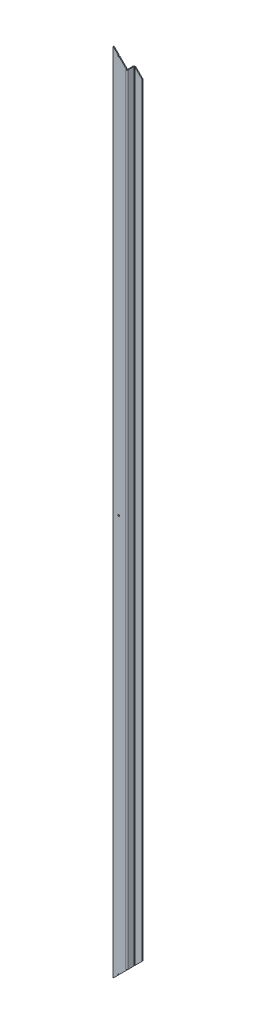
ISO-10303-21;
HEADER;
FILE_DESCRIPTION(('STEP AP214'),'2;1');
FILE_NAME('part.step','',(''),(''),'','','');
FILE_SCHEMA(('AUTOMOTIVE_DESIGN { 1 0 10303 214 1 1 1 1 }'));
ENDSEC;
DATA;
#1=APPLICATION_CONTEXT('core data for automotive mechanical design processes');
#2=APPLICATION_PROTOCOL_DEFINITION('international standard','automotive_design',2000,#1);
#3=PRODUCT_CONTEXT('',#1,'mechanical');
#4=PRODUCT('Part','Part','',(#3));
#5=PRODUCT_RELATED_PRODUCT_CATEGORY('part','',(#4));
#6=PRODUCT_DEFINITION_FORMATION('','',#4);
#7=PRODUCT_DEFINITION_CONTEXT('part definition',#1,'design');
#8=PRODUCT_DEFINITION('design','',#6,#7);
#9=PRODUCT_DEFINITION_SHAPE('','',#8);
#10=(LENGTH_UNIT() NAMED_UNIT(*) SI_UNIT(.MILLI.,.METRE.));
#11=(NAMED_UNIT(*) PLANE_ANGLE_UNIT() SI_UNIT($,.RADIAN.));
#12=(NAMED_UNIT(*) SI_UNIT($,.STERADIAN.) SOLID_ANGLE_UNIT());
#13=UNCERTAINTY_MEASURE_WITH_UNIT(LENGTH_MEASURE(1.E-05),#10,'distance_accuracy_value','');
#14=(GEOMETRIC_REPRESENTATION_CONTEXT(3) GLOBAL_UNCERTAINTY_ASSIGNED_CONTEXT((#13)) GLOBAL_UNIT_ASSIGNED_CONTEXT((#10,
#11,#12)) REPRESENTATION_CONTEXT('',''));
#15=CARTESIAN_POINT('',(0.,0.,0.));
#16=DIRECTION('',(0.,0.,1.));
#17=DIRECTION('',(1.,0.,0.));
#18=AXIS2_PLACEMENT_3D('',#15,#16,#17);
#19=CARTESIAN_POINT('',(-159.,703.,1.5));
#20=DIRECTION('',(-0.707106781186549,-0.707106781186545,0.));
#21=DIRECTION('',(0.707106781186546,-0.707106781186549,0.));
#22=AXIS2_PLACEMENT_3D('',#19,#20,#21);
#23=PLANE('',#22);
#24=DIRECTION('',(-0.707106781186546,0.707106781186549,0.));
#25=VECTOR('',#24,1.);
#26=CARTESIAN_POINT('',(-159.,703.,0.));
#27=LINE('',#26,#25);
#28=CARTESIAN_POINT('',(-159.,703.,0.));
#29=VERTEX_POINT('',#28);
#30=CARTESIAN_POINT('',(-172.93933982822,716.93933982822,0.));
#31=VERTEX_POINT('',#30);
#32=EDGE_CURVE('E238',#29,#31,#27,.T.);
#33=ORIENTED_EDGE('',*,*,#32,.T.);
#34=DIRECTION('',(0.,0.,1.));
#35=VECTOR('',#34,1.);
#36=CARTESIAN_POINT('',(-172.93933982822,716.93933982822,0.));
#37=LINE('',#36,#35);
#38=CARTESIAN_POINT('',(-172.93933982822,716.93933982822,1.5));
#39=VERTEX_POINT('',#38);
#40=EDGE_CURVE('E13',#31,#39,#37,.T.);
#41=ORIENTED_EDGE('',*,*,#40,.T.);
#42=DIRECTION('',(-0.707106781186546,0.707106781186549,0.));
#43=VECTOR('',#42,1.);
#44=CARTESIAN_POINT('',(-159.,703.,1.5));
#45=LINE('',#44,#43);
#46=CARTESIAN_POINT('',(-159.,703.,1.5));
#47=VERTEX_POINT('',#46);
#48=EDGE_CURVE('E234',#47,#39,#45,.T.);
#49=ORIENTED_EDGE('',*,*,#48,.F.);
#50=DIRECTION('',(0.,0.,-1.));
#51=VECTOR('',#50,1.);
#52=CARTESIAN_POINT('',(-159.,703.,1.5));
#53=LINE('',#52,#51);
#54=EDGE_CURVE('E256',#47,#29,#53,.T.);
#55=ORIENTED_EDGE('',*,*,#54,.T.);
#56=EDGE_LOOP('',(#33,#41,#49,#55));
#57=FACE_BOUND('',#56,.T.);
#58=ADVANCED_FACE('F78',(#57),#23,.F.);
#59=CARTESIAN_POINT('',(-159.,-703.,1.5));
#60=DIRECTION('',(-0.707106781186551,0.707106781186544,0.));
#61=DIRECTION('',(-0.707106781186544,-0.707106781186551,0.));
#62=AXIS2_PLACEMENT_3D('',#59,#60,#61);
#63=PLANE('',#62);
#64=DIRECTION('',(0.707106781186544,0.707106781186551,0.));
#65=VECTOR('',#64,1.);
#66=CARTESIAN_POINT('',(-159.,-703.,0.));
#67=LINE('',#66,#65);
#68=CARTESIAN_POINT('',(-184.,-728.,0.));
#69=VERTEX_POINT('',#68);
#70=CARTESIAN_POINT('',(-175.060660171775,-719.060660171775,0.));
#71=VERTEX_POINT('',#70);
#72=EDGE_CURVE('E245',#69,#71,#67,.T.);
#73=ORIENTED_EDGE('',*,*,#72,.T.);
#74=DIRECTION('',(0.,0.,1.));
#75=VECTOR('',#74,1.);
#76=CARTESIAN_POINT('',(-175.060660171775,-719.060660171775,0.));
#77=LINE('',#76,#75);
#78=CARTESIAN_POINT('',(-175.060660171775,-719.060660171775,1.5));
#79=VERTEX_POINT('',#78);
#80=EDGE_CURVE('E214',#71,#79,#77,.T.);
#81=ORIENTED_EDGE('',*,*,#80,.T.);
#82=DIRECTION('',(0.707106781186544,0.707106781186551,0.));
#83=VECTOR('',#82,1.);
#84=CARTESIAN_POINT('',(-159.,-703.,1.5));
#85=LINE('',#84,#83);
#86=CARTESIAN_POINT('',(-184.,-728.,1.5));
#87=VERTEX_POINT('',#86);
#88=EDGE_CURVE('E226',#87,#79,#85,.T.);
#89=ORIENTED_EDGE('',*,*,#88,.F.);
#90=DIRECTION('',(0.,0.,-1.));
#91=VECTOR('',#90,1.);
#92=CARTESIAN_POINT('',(-184.,-728.,1.5));
#93=LINE('',#92,#91);
#94=EDGE_CURVE('E250',#87,#69,#93,.T.);
#95=ORIENTED_EDGE('',*,*,#94,.T.);
#96=EDGE_LOOP('',(#73,#81,#89,#95));
#97=FACE_BOUND('',#96,.T.);
#98=ADVANCED_FACE('F283',(#97),#63,.F.);
#99=CARTESIAN_POINT('',(-159.,703.,-13.3));
#100=DIRECTION('',(0.,1.,0.));
#101=DIRECTION('',(0.,0.,1.));
#102=AXIS2_PLACEMENT_3D('',#99,#100,#101);
#103=PLANE('',#102);
#104=DIRECTION('',(0.,0.,-1.));
#105=VECTOR('',#104,1.);
#106=CARTESIAN_POINT('',(-159.,703.,-13.3));
#107=LINE('',#106,#105);
#108=CARTESIAN_POINT('',(-159.,703.,-0.999999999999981));
#109=VERTEX_POINT('',#108);
#110=CARTESIAN_POINT('',(-159.,703.,-10.8));
#111=VERTEX_POINT('',#110);
#112=EDGE_CURVE('E503',#109,#111,#107,.T.);
#113=ORIENTED_EDGE('',*,*,#112,.T.);
#114=DIRECTION('',(-1.,0.,0.));
#115=VECTOR('',#114,1.);
#116=CARTESIAN_POINT('',(-159.,703.,-10.8));
#117=LINE('',#116,#115);
#118=CARTESIAN_POINT('',(-160.5,703.,-10.8));
#119=VERTEX_POINT('',#118);
#120=EDGE_CURVE('E335',#111,#119,#117,.T.);
#121=ORIENTED_EDGE('',*,*,#120,.T.);
#122=DIRECTION('',(0.,0.,1.));
#123=VECTOR('',#122,1.);
#124=CARTESIAN_POINT('',(-160.5,703.,-6.63629552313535E-13));
#125=LINE('',#124,#123);
#126=CARTESIAN_POINT('',(-160.5,703.,-0.999999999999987));
#127=VERTEX_POINT('',#126);
#128=EDGE_CURVE('E500',#127,#119,#125,.F.);
#129=ORIENTED_EDGE('',*,*,#128,.F.);
#130=DIRECTION('',(1.,0.,0.));
#131=VECTOR('',#130,1.);
#132=CARTESIAN_POINT('',(-159.,703.,-0.999999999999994));
#133=LINE('',#132,#131);
#134=EDGE_CURVE('E334',#127,#109,#133,.T.);
#135=ORIENTED_EDGE('',*,*,#134,.T.);
#136=EDGE_LOOP('',(#113,#121,#129,#135));
#137=FACE_BOUND('',#136,.T.);
#138=ADVANCED_FACE('F399',(#137),#103,.T.);
#139=CARTESIAN_POINT('',(-159.,0.,-6.5839233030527E-13));
#140=DIRECTION('',(1.,0.,0.));
#141=DIRECTION('',(0.,0.,-1.));
#142=AXIS2_PLACEMENT_3D('',#139,#140,#141);
#143=PLANE('',#142);
#144=DIRECTION('',(0.,0.,1.));
#145=VECTOR('',#144,1.);
#146=CARTESIAN_POINT('',(-159.,-703.,0.));
#147=LINE('',#146,#145);
#148=CARTESIAN_POINT('',(-159.,-703.,-10.8));
#149=VERTEX_POINT('',#148);
#150=CARTESIAN_POINT('',(-159.,-703.,-0.999999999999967));
#151=VERTEX_POINT('',#150);
#152=EDGE_CURVE('E381',#149,#151,#147,.T.);
#153=ORIENTED_EDGE('',*,*,#152,.F.);
#154=DIRECTION('',(0.,1.,0.));
#155=VECTOR('',#154,1.);
#156=CARTESIAN_POINT('',(-159.,703.,-10.8));
#157=LINE('',#156,#155);
#158=EDGE_CURVE('E323',#111,#149,#157,.F.);
#159=ORIENTED_EDGE('',*,*,#158,.F.);
#160=ORIENTED_EDGE('',*,*,#112,.F.);
#161=DIRECTION('',(0.,-1.,0.));
#162=VECTOR('',#161,1.);
#163=CARTESIAN_POINT('',(-159.,0.,-0.99999999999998));
#164=LINE('',#163,#162);
#165=EDGE_CURVE('E469',#109,#151,#164,.T.);
#166=ORIENTED_EDGE('',*,*,#165,.T.);
#167=EDGE_LOOP('',(#153,#159,#160,#166));
#168=FACE_BOUND('',#167,.T.);
#169=ADVANCED_FACE('F389',(#168),#143,.T.);
#170=CARTESIAN_POINT('',(-160.5,0.,-6.63629552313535E-13));
#171=DIRECTION('',(1.,0.,0.));
#172=DIRECTION('',(0.,0.,-1.));
#173=AXIS2_PLACEMENT_3D('',#170,#171,#172);
#174=PLANE('',#173);
#175=DIRECTION('',(0.,1.,0.));
#176=VECTOR('',#175,1.);
#177=CARTESIAN_POINT('',(-160.5,703.,-10.8));
#178=LINE('',#177,#176);
#179=CARTESIAN_POINT('',(-160.5,-703.,-10.8));
#180=VERTEX_POINT('',#179);
#181=EDGE_CURVE('E327',#119,#180,#178,.F.);
#182=ORIENTED_EDGE('',*,*,#181,.T.);
#183=DIRECTION('',(0.,0.,-1.));
#184=VECTOR('',#183,1.);
#185=CARTESIAN_POINT('',(-160.5,-703.,-6.63629552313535E-13));
#186=LINE('',#185,#184);
#187=CARTESIAN_POINT('',(-160.5,-703.,-0.999999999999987));
#188=VERTEX_POINT('',#187);
#189=EDGE_CURVE('E502',#180,#188,#186,.F.);
#190=ORIENTED_EDGE('',*,*,#189,.T.);
#191=DIRECTION('',(0.,1.,0.));
#192=VECTOR('',#191,1.);
#193=CARTESIAN_POINT('',(-160.5,703.,-1.));
#194=LINE('',#193,#192);
#195=EDGE_CURVE('E492',#127,#188,#194,.F.);
#196=ORIENTED_EDGE('',*,*,#195,.F.);
#197=ORIENTED_EDGE('',*,*,#128,.T.);
#198=EDGE_LOOP('',(#182,#190,#196,#197));
#199=FACE_BOUND('',#198,.T.);
#200=ADVANCED_FACE('F398',(#199),#174,.F.);
#201=CARTESIAN_POINT('',(-159.,-703.,0.));
#202=DIRECTION('',(0.,1.,0.));
#203=DIRECTION('',(0.,0.,1.));
#204=AXIS2_PLACEMENT_3D('',#201,#202,#203);
#205=PLANE('',#204);
#206=DIRECTION('',(-1.,0.,0.));
#207=VECTOR('',#206,1.);
#208=CARTESIAN_POINT('',(-159.,-703.,0.));
#209=LINE('',#208,#207);
#210=CARTESIAN_POINT('',(-159.,-703.,0.));
#211=VERTEX_POINT('',#210);
#212=CARTESIAN_POINT('',(-159.208712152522,-703.,0.));
#213=VERTEX_POINT('',#212);
#214=EDGE_CURVE('E272',#211,#213,#209,.T.);
#215=ORIENTED_EDGE('',*,*,#214,.T.);
#216=CARTESIAN_POINT('',(-161.5,-703.,-0.999999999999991));
#217=DIRECTION('',(0.,-1.,0.));
#218=DIRECTION('',(0.,0.,-1.));
#219=AXIS2_PLACEMENT_3D('',#216,#217,#218);
#220=CIRCLE('',#219,2.5);
#221=CARTESIAN_POINT('',(-161.5,-703.,1.5));
#222=VERTEX_POINT('',#221);
#223=EDGE_CURVE('E215',#213,#222,#220,.T.);
#224=ORIENTED_EDGE('',*,*,#223,.T.);
#225=DIRECTION('',(-1.,0.,0.));
#226=VECTOR('',#225,1.);
#227=CARTESIAN_POINT('',(0.,-703.,1.5));
#228=LINE('',#227,#226);
#229=CARTESIAN_POINT('',(-159.,-703.,1.5));
#230=VERTEX_POINT('',#229);
#231=EDGE_CURVE('E268',#230,#222,#228,.T.);
#232=ORIENTED_EDGE('',*,*,#231,.F.);
#233=DIRECTION('',(0.,0.,-1.));
#234=VECTOR('',#233,1.);
#235=CARTESIAN_POINT('',(-159.,-703.,1.5));
#236=LINE('',#235,#234);
#237=EDGE_CURVE('E230',#230,#211,#236,.T.);
#238=ORIENTED_EDGE('',*,*,#237,.T.);
#239=EDGE_LOOP('',(#215,#224,#232,#238));
#240=FACE_BOUND('',#239,.T.);
#241=ADVANCED_FACE('F403',(#240),#205,.T.);
#242=CARTESIAN_POINT('',(-161.5,703.,0.));
#243=DIRECTION('',(0.,-1.,0.));
#244=DIRECTION('',(0.,0.,-1.));
#245=AXIS2_PLACEMENT_3D('',#242,#243,#244);
#246=PLANE('',#245);
#247=DIRECTION('',(1.,0.,0.));
#248=VECTOR('',#247,1.);
#249=CARTESIAN_POINT('',(0.,703.,1.5));
#250=LINE('',#249,#248);
#251=CARTESIAN_POINT('',(-161.5,703.,1.5));
#252=VERTEX_POINT('',#251);
#253=EDGE_CURVE('E269',#252,#47,#250,.T.);
#254=ORIENTED_EDGE('',*,*,#253,.F.);
#255=CARTESIAN_POINT('',(-161.5,703.,-0.999999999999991));
#256=DIRECTION('',(0.,-1.,0.));
#257=DIRECTION('',(0.,0.,-1.));
#258=AXIS2_PLACEMENT_3D('',#255,#256,#257);
#259=CIRCLE('',#258,2.5);
#260=CARTESIAN_POINT('',(-159.208712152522,703.,0.));
#261=VERTEX_POINT('',#260);
#262=EDGE_CURVE('E456',#252,#261,#259,.F.);
#263=ORIENTED_EDGE('',*,*,#262,.T.);
#264=DIRECTION('',(1.,0.,0.));
#265=VECTOR('',#264,1.);
#266=CARTESIAN_POINT('',(-161.5,703.,0.));
#267=LINE('',#266,#265);
#268=EDGE_CURVE('E451',#261,#29,#267,.T.);
#269=ORIENTED_EDGE('',*,*,#268,.T.);
#270=ORIENTED_EDGE('',*,*,#54,.F.);
#271=EDGE_LOOP('',(#254,#263,#269,#270));
#272=FACE_BOUND('',#271,.T.);
#273=ADVANCED_FACE('F428',(#272),#246,.T.);
#274=CARTESIAN_POINT('',(0.,0.,1.5));
#275=DIRECTION('',(0.,0.,1.));
#276=DIRECTION('',(1.,0.,0.));
#277=AXIS2_PLACEMENT_3D('',#274,#275,#276);
#278=PLANE('',#277);
#279=CARTESIAN_POINT('',(-174.,718.,1.5));
#280=DIRECTION('',(0.,0.,1.));
#281=DIRECTION('',(1.,0.,0.));
#282=AXIS2_PLACEMENT_3D('',#279,#280,#281);
#283=CIRCLE('',#282,1.5);
#284=CARTESIAN_POINT('',(-175.06066017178,719.06066017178,1.5));
#285=VERTEX_POINT('',#284);
#286=EDGE_CURVE('E279',#285,#39,#283,.T.);
#287=ORIENTED_EDGE('',*,*,#286,.F.);
#288=CARTESIAN_POINT('',(-184.,728.,1.5));
#289=VERTEX_POINT('',#288);
#290=EDGE_CURVE('E248',#285,#289,#45,.T.);
#291=ORIENTED_EDGE('',*,*,#290,.T.);
#292=DIRECTION('',(0.,-1.,0.));
#293=VECTOR('',#292,1.);
#294=CARTESIAN_POINT('',(-184.,-728.,1.5));
#295=LINE('',#294,#293);
#296=EDGE_CURVE('E232',#289,#87,#295,.T.);
#297=ORIENTED_EDGE('',*,*,#296,.T.);
#298=ORIENTED_EDGE('',*,*,#88,.T.);
#299=CARTESIAN_POINT('',(-173.999999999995,-717.999999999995,1.5));
#300=DIRECTION('',(0.,0.,1.));
#301=DIRECTION('',(1.,0.,0.));
#302=AXIS2_PLACEMENT_3D('',#299,#300,#301);
#303=CIRCLE('',#302,1.5);
#304=CARTESIAN_POINT('',(-172.939339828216,-716.939339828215,1.5));
#305=VERTEX_POINT('',#304);
#306=EDGE_CURVE('E209',#305,#79,#303,.T.);
#307=ORIENTED_EDGE('',*,*,#306,.F.);
#308=EDGE_CURVE('E223',#305,#230,#85,.T.);
#309=ORIENTED_EDGE('',*,*,#308,.T.);
#310=ORIENTED_EDGE('',*,*,#231,.T.);
#311=DIRECTION('',(0.,-1.,0.));
#312=VECTOR('',#311,1.);
#313=CARTESIAN_POINT('',(-161.5,-703.,1.50000000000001));
#314=LINE('',#313,#312);
#315=EDGE_CURVE('E471',#222,#252,#314,.F.);
#316=ORIENTED_EDGE('',*,*,#315,.T.);
#317=ORIENTED_EDGE('',*,*,#253,.T.);
#318=ORIENTED_EDGE('',*,*,#48,.T.);
#319=EDGE_LOOP('',(#287,#291,#297,#298,#307,#309,#310,#316,#317,#318));
#320=FACE_BOUND('',#319,.T.);
#321=CARTESIAN_POINT('',(-173.999999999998,2.44249065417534E-12,1.5));
#322=DIRECTION('',(0.,0.,1.));
#323=DIRECTION('',(1.,0.,0.));
#324=AXIS2_PLACEMENT_3D('',#321,#322,#323);
#325=CIRCLE('',#324,1.5);
#326=CARTESIAN_POINT('',(-172.499999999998,2.44249065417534E-12,1.5));
#327=VERTEX_POINT('',#326);
#328=EDGE_CURVE('E285',#327,#327,#325,.T.);
#329=ORIENTED_EDGE('',*,*,#328,.F.);
#330=EDGE_LOOP('',(#329));
#331=FACE_BOUND('',#330,.T.);
#332=ADVANCED_FACE('F220',(#320,#331),#278,.T.);
#333=CARTESIAN_POINT('',(0.,0.,0.));
#334=DIRECTION('',(0.,0.,1.));
#335=DIRECTION('',(1.,0.,0.));
#336=AXIS2_PLACEMENT_3D('',#333,#334,#335);
#337=PLANE('',#336);
#338=CARTESIAN_POINT('',(-173.999999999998,2.44249065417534E-12,0.));
#339=DIRECTION('',(0.,0.,1.));
#340=DIRECTION('',(1.,0.,0.));
#341=AXIS2_PLACEMENT_3D('',#338,#339,#340);
#342=CIRCLE('',#341,1.5);
#343=CARTESIAN_POINT('',(-172.499999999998,2.44249065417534E-12,0.));
#344=VERTEX_POINT('',#343);
#345=EDGE_CURVE('E288',#344,#344,#342,.T.);
#346=ORIENTED_EDGE('',*,*,#345,.T.);
#347=EDGE_LOOP('',(#346));
#348=FACE_BOUND('',#347,.T.);
#349=CARTESIAN_POINT('',(-175.06066017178,719.06066017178,0.));
#350=VERTEX_POINT('',#349);
#351=CARTESIAN_POINT('',(-184.,728.,0.));
#352=VERTEX_POINT('',#351);
#353=EDGE_CURVE('E242',#350,#352,#27,.T.);
#354=ORIENTED_EDGE('',*,*,#353,.F.);
#355=CARTESIAN_POINT('',(-174.,718.,0.));
#356=DIRECTION('',(0.,0.,1.));
#357=DIRECTION('',(1.,0.,0.));
#358=AXIS2_PLACEMENT_3D('',#355,#356,#357);
#359=CIRCLE('',#358,1.5);
#360=EDGE_CURVE('E93',#350,#31,#359,.T.);
#361=ORIENTED_EDGE('',*,*,#360,.T.);
#362=ORIENTED_EDGE('',*,*,#32,.F.);
#363=ORIENTED_EDGE('',*,*,#268,.F.);
#364=CARTESIAN_POINT('',(-161.5,703.,0.));
#365=VERTEX_POINT('',#364);
#366=EDGE_CURVE('E454',#365,#261,#267,.T.);
#367=ORIENTED_EDGE('',*,*,#366,.F.);
#368=DIRECTION('',(0.,-1.,0.));
#369=VECTOR('',#368,1.);
#370=CARTESIAN_POINT('',(-161.5,-703.,0.));
#371=LINE('',#370,#369);
#372=CARTESIAN_POINT('',(-161.5,-703.,0.));
#373=VERTEX_POINT('',#372);
#374=EDGE_CURVE('E479',#373,#365,#371,.F.);
#375=ORIENTED_EDGE('',*,*,#374,.F.);
#376=EDGE_CURVE('E466',#213,#373,#209,.T.);
#377=ORIENTED_EDGE('',*,*,#376,.F.);
#378=ORIENTED_EDGE('',*,*,#214,.F.);
#379=CARTESIAN_POINT('',(-172.939339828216,-716.939339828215,0.));
#380=VERTEX_POINT('',#379);
#381=EDGE_CURVE('E244',#380,#211,#67,.T.);
#382=ORIENTED_EDGE('',*,*,#381,.F.);
#383=CARTESIAN_POINT('',(-173.999999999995,-717.999999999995,0.));
#384=DIRECTION('',(0.,0.,1.));
#385=DIRECTION('',(1.,0.,0.));
#386=AXIS2_PLACEMENT_3D('',#383,#384,#385);
#387=CIRCLE('',#386,1.5);
#388=EDGE_CURVE('E101',#380,#71,#387,.T.);
#389=ORIENTED_EDGE('',*,*,#388,.T.);
#390=ORIENTED_EDGE('',*,*,#72,.F.);
#391=DIRECTION('',(0.,-1.,0.));
#392=VECTOR('',#391,1.);
#393=CARTESIAN_POINT('',(-184.,-728.,0.));
#394=LINE('',#393,#392);
#395=EDGE_CURVE('E241',#352,#69,#394,.T.);
#396=ORIENTED_EDGE('',*,*,#395,.F.);
#397=EDGE_LOOP('',(#354,#361,#362,#363,#367,#375,#377,#378,#382,#389,#390,#396));
#398=FACE_BOUND('',#397,.T.);
#399=ADVANCED_FACE('F265',(#348,#398),#337,.F.);
#400=ORIENTED_EDGE('',*,*,#290,.F.);
#401=DIRECTION('',(0.,0.,1.));
#402=VECTOR('',#401,1.);
#403=CARTESIAN_POINT('',(-175.06066017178,719.06066017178,0.));
#404=LINE('',#403,#402);
#405=EDGE_CURVE('E86',#285,#350,#404,.F.);
#406=ORIENTED_EDGE('',*,*,#405,.T.);
#407=ORIENTED_EDGE('',*,*,#353,.T.);
#408=DIRECTION('',(0.,0.,-1.));
#409=VECTOR('',#408,1.);
#410=CARTESIAN_POINT('',(-184.,728.,1.5));
#411=LINE('',#410,#409);
#412=EDGE_CURVE('E253',#289,#352,#411,.T.);
#413=ORIENTED_EDGE('',*,*,#412,.F.);
#414=EDGE_LOOP('',(#400,#406,#407,#413));
#415=FACE_BOUND('',#414,.T.);
#416=ADVANCED_FACE('F80',(#415),#23,.F.);
#417=CARTESIAN_POINT('',(-184.,-728.,1.5));
#418=DIRECTION('',(1.,0.,0.));
#419=DIRECTION('',(0.,0.,-1.));
#420=AXIS2_PLACEMENT_3D('',#417,#418,#419);
#421=PLANE('',#420);
#422=ORIENTED_EDGE('',*,*,#395,.T.);
#423=ORIENTED_EDGE('',*,*,#94,.F.);
#424=ORIENTED_EDGE('',*,*,#296,.F.);
#425=ORIENTED_EDGE('',*,*,#412,.T.);
#426=EDGE_LOOP('',(#422,#423,#424,#425));
#427=FACE_BOUND('',#426,.T.);
#428=ADVANCED_FACE('F281',(#427),#421,.F.);
#429=ORIENTED_EDGE('',*,*,#308,.F.);
#430=DIRECTION('',(0.,0.,1.));
#431=VECTOR('',#430,1.);
#432=CARTESIAN_POINT('',(-172.939339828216,-716.939339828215,0.));
#433=LINE('',#432,#431);
#434=EDGE_CURVE('E206',#305,#380,#433,.F.);
#435=ORIENTED_EDGE('',*,*,#434,.T.);
#436=ORIENTED_EDGE('',*,*,#381,.T.);
#437=ORIENTED_EDGE('',*,*,#237,.F.);
#438=EDGE_LOOP('',(#429,#435,#436,#437));
#439=FACE_BOUND('',#438,.T.);
#440=ADVANCED_FACE('F228',(#439),#63,.F.);
#441=CARTESIAN_POINT('',(-161.5,703.,-0.999999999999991));
#442=DIRECTION('',(0.,1.,0.));
#443=DIRECTION('',(0.,0.,1.));
#444=AXIS2_PLACEMENT_3D('',#441,#442,#443);
#445=PLANE('',#444);
#446=CARTESIAN_POINT('',(-161.5,703.,-0.999999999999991));
#447=DIRECTION('',(0.,-1.,0.));
#448=DIRECTION('',(0.,0.,-1.));
#449=AXIS2_PLACEMENT_3D('',#446,#447,#448);
#450=CIRCLE('',#449,1.);
#451=EDGE_CURVE('E465',#365,#127,#450,.F.);
#452=ORIENTED_EDGE('',*,*,#451,.F.);
#453=ORIENTED_EDGE('',*,*,#366,.T.);
#454=EDGE_CURVE('E460',#261,#109,#259,.F.);
#455=ORIENTED_EDGE('',*,*,#454,.T.);
#456=ORIENTED_EDGE('',*,*,#134,.F.);
#457=EDGE_LOOP('',(#452,#453,#455,#456));
#458=FACE_BOUND('',#457,.T.);
#459=ADVANCED_FACE('F421',(#458),#445,.T.);
#460=CARTESIAN_POINT('',(-161.5,-703.,-0.999999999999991));
#461=DIRECTION('',(0.,1.,0.));
#462=DIRECTION('',(0.,0.,1.));
#463=AXIS2_PLACEMENT_3D('',#460,#461,#462);
#464=PLANE('',#463);
#465=EDGE_CURVE('E472',#151,#213,#220,.T.);
#466=ORIENTED_EDGE('',*,*,#465,.T.);
#467=ORIENTED_EDGE('',*,*,#376,.T.);
#468=CARTESIAN_POINT('',(-161.5,-703.,-0.999999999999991));
#469=DIRECTION('',(0.,-1.,0.));
#470=DIRECTION('',(0.,0.,-1.));
#471=AXIS2_PLACEMENT_3D('',#468,#469,#470);
#472=CIRCLE('',#471,1.);
#473=EDGE_CURVE('E481',#188,#373,#472,.T.);
#474=ORIENTED_EDGE('',*,*,#473,.F.);
#475=DIRECTION('',(1.,0.,0.));
#476=VECTOR('',#475,1.);
#477=CARTESIAN_POINT('',(-160.5,-703.,-0.999999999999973));
#478=LINE('',#477,#476);
#479=EDGE_CURVE('E495',#188,#151,#478,.T.);
#480=ORIENTED_EDGE('',*,*,#479,.T.);
#481=EDGE_LOOP('',(#466,#467,#474,#480));
#482=FACE_BOUND('',#481,.T.);
#483=ADVANCED_FACE('F416',(#482),#464,.F.);
#484=CARTESIAN_POINT('',(-161.5,-703.,-0.999999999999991));
#485=DIRECTION('',(0.,-1.,0.));
#486=DIRECTION('',(1.,0.,0.));
#487=AXIS2_PLACEMENT_3D('',#484,#485,#486);
#488=CYLINDRICAL_SURFACE('',#487,2.5);
#489=ORIENTED_EDGE('',*,*,#315,.F.);
#490=ORIENTED_EDGE('',*,*,#223,.F.);
#491=ORIENTED_EDGE('',*,*,#465,.F.);
#492=ORIENTED_EDGE('',*,*,#165,.F.);
#493=ORIENTED_EDGE('',*,*,#454,.F.);
#494=ORIENTED_EDGE('',*,*,#262,.F.);
#495=EDGE_LOOP('',(#489,#490,#491,#492,#493,#494));
#496=FACE_BOUND('',#495,.T.);
#497=ADVANCED_FACE('F413',(#496),#488,.T.);
#498=CARTESIAN_POINT('',(-161.5,-703.,-0.999999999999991));
#499=DIRECTION('',(0.,-1.,0.));
#500=DIRECTION('',(1.,0.,0.));
#501=AXIS2_PLACEMENT_3D('',#498,#499,#500);
#502=CYLINDRICAL_SURFACE('',#501,1.);
#503=ORIENTED_EDGE('',*,*,#374,.T.);
#504=ORIENTED_EDGE('',*,*,#451,.T.);
#505=ORIENTED_EDGE('',*,*,#195,.T.);
#506=ORIENTED_EDGE('',*,*,#473,.T.);
#507=EDGE_LOOP('',(#503,#504,#505,#506));
#508=FACE_BOUND('',#507,.T.);
#509=ADVANCED_FACE('F408',(#508),#502,.F.);
#510=CARTESIAN_POINT('',(-159.,-703.,0.));
#511=DIRECTION('',(0.,-1.,0.));
#512=DIRECTION('',(0.,0.,-1.));
#513=AXIS2_PLACEMENT_3D('',#510,#511,#512);
#514=PLANE('',#513);
#515=DIRECTION('',(-1.,0.,0.));
#516=VECTOR('',#515,1.);
#517=CARTESIAN_POINT('',(-159.,-703.,-10.8));
#518=LINE('',#517,#516);
#519=EDGE_CURVE('E331',#149,#180,#518,.T.);
#520=ORIENTED_EDGE('',*,*,#519,.F.);
#521=ORIENTED_EDGE('',*,*,#152,.T.);
#522=ORIENTED_EDGE('',*,*,#479,.F.);
#523=ORIENTED_EDGE('',*,*,#189,.F.);
#524=EDGE_LOOP('',(#520,#521,#522,#523));
#525=FACE_BOUND('',#524,.T.);
#526=ADVANCED_FACE('F405',(#525),#514,.T.);
#527=CARTESIAN_POINT('',(-160.515,-703.,-10.8));
#528=CARTESIAN_POINT('',(-160.515,-702.91665252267,-11.1292685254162));
#529=CARTESIAN_POINT('',(-160.449541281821,-702.833333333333,-11.4582959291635));
#530=CARTESIAN_POINT('',(-160.197572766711,-702.666666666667,-12.0666017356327));
#531=CARTESIAN_POINT('',(-160.011162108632,-702.583333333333,-12.3455850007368));
#532=CARTESIAN_POINT('',(-159.545585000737,-702.416666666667,-12.8111621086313));
#533=CARTESIAN_POINT('',(-159.266601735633,-702.333333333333,-12.9975727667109));
#534=CARTESIAN_POINT('',(-158.658295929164,-702.166666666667,-13.2495412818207));
#535=CARTESIAN_POINT('',(-158.329268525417,-702.083347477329,-13.315));
#536=CARTESIAN_POINT('',(-158.,-702.,-13.315));
#537=CARTESIAN_POINT('',(-160.5,-703.,-10.8));
#538=CARTESIAN_POINT('',(-160.5,-702.916652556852,-11.1273046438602));
#539=CARTESIAN_POINT('',(-160.434931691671,-702.833333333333,-11.4543697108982));
#540=CARTESIAN_POINT('',(-160.184465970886,-702.666666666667,-12.0590474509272));
#541=CARTESIAN_POINT('',(-159.999167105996,-702.583333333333,-12.3363667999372));
#542=CARTESIAN_POINT('',(-159.536366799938,-702.416666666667,-12.7991671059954));
#543=CARTESIAN_POINT('',(-159.259047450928,-702.333333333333,-12.9844659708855));
#544=CARTESIAN_POINT('',(-158.654369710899,-702.166666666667,-13.2349316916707));
#545=CARTESIAN_POINT('',(-158.327304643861,-702.083347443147,-13.3));
#546=CARTESIAN_POINT('',(-158.,-702.,-13.3));
#547=CARTESIAN_POINT('',(-159.,-703.,-10.8));
#548=CARTESIAN_POINT('',(-159.,-702.916655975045,-10.93091648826));
#549=CARTESIAN_POINT('',(-158.973972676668,-702.833333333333,-11.0617478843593));
#550=CARTESIAN_POINT('',(-158.873786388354,-702.666666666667,-11.3036189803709));
#551=CARTESIAN_POINT('',(-158.799666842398,-702.583333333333,-11.4145467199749));
#552=CARTESIAN_POINT('',(-158.614546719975,-702.416666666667,-11.5996668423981));
#553=CARTESIAN_POINT('',(-158.503618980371,-702.333333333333,-11.6737863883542));
#554=CARTESIAN_POINT('',(-158.26174788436,-702.166666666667,-11.7739726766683));
#555=CARTESIAN_POINT('',(-158.13091648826,-702.083344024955,-11.8));
#556=CARTESIAN_POINT('',(-158.,-702.,-11.8));
#557=CARTESIAN_POINT('',(-158.98485,-703.,-10.8));
#558=CARTESIAN_POINT('',(-158.98485,-702.916656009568,-10.9289329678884));
#559=CARTESIAN_POINT('',(-158.959216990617,-702.833333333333,-11.0577824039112));
#560=CARTESIAN_POINT('',(-158.860548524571,-702.666666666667,-11.2959891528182));
#561=CARTESIAN_POINT('',(-158.787551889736,-702.583333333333,-11.4052363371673));
#562=CARTESIAN_POINT('',(-158.605236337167,-702.416666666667,-11.5875518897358));
#563=CARTESIAN_POINT('',(-158.495989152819,-702.333333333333,-11.6605485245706));
#564=CARTESIAN_POINT('',(-158.257782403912,-702.166666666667,-11.7592169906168));
#565=CARTESIAN_POINT('',(-158.128932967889,-702.083343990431,-11.78485));
#566=CARTESIAN_POINT('',(-158.,-702.,-11.78485));
#567=B_SPLINE_SURFACE_WITH_KNOTS('',1,3,((#527,#528,#529,#530,#531,#532,#533,#534,#535,#536),
(#537,#538,#539,#540,#541,#542,#543,#544,#545,#546),(#547,#548,#549,#550,#551,#552,#553,#554,
#555,#556),(#557,#558,#559,#560,#561,#562,#563,#564,#565,#566)),.UNSPECIFIED.,.F.,.F.,.F.,(2,1,
1,2),(4,2,2,2,4),(-0.01,0.,1.,1.0101),(0.,0.25,0.5,0.75,1.),.UNSPECIFIED.);
#568=DIRECTION('',(0.,0.,1.));
#569=VECTOR('',#568,1.);
#570=CARTESIAN_POINT('',(-158.,-702.,-13.3));
#571=LINE('',#570,#569);
#572=CARTESIAN_POINT('',(-158.,-702.,-11.8));
#573=VERTEX_POINT('',#572);
#574=CARTESIAN_POINT('',(-158.,-702.,-13.3));
#575=VERTEX_POINT('',#574);
#576=EDGE_CURVE('E320',#573,#575,#571,.F.);
#577=CARTESIAN_POINT('',(-159.,-703.,-10.8));
#578=CARTESIAN_POINT('',(-159.000007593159,-702.977104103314,-10.8359623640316));
#579=CARTESIAN_POINT('',(-158.998060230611,-702.954210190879,-10.8719230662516));
#580=CARTESIAN_POINT('',(-158.990312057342,-702.908423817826,-10.9434269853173));
#581=CARTESIAN_POINT('',(-158.984511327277,-702.885531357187,-10.9789702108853));
#582=CARTESIAN_POINT('',(-158.969124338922,-702.839778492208,-11.0491742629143));
#583=CARTESIAN_POINT('',(-158.959543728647,-702.816918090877,-11.0838363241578));
#584=CARTESIAN_POINT('',(-158.936720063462,-702.771204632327,-11.1519180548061));
#585=CARTESIAN_POINT('',(-158.923477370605,-702.748351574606,-11.1853378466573));
#586=CARTESIAN_POINT('',(-158.88056471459,-702.682999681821,-11.2785905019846));
#587=CARTESIAN_POINT('',(-158.846550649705,-702.640473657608,-11.336474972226));
#588=CARTESIAN_POINT('',(-158.767722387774,-702.555464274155,-11.4442546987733));
#589=CARTESIAN_POINT('',(-158.722914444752,-702.512980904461,-11.4941545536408));
#590=CARTESIAN_POINT('',(-158.62426999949,-702.428015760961,-11.5840518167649));
#591=CARTESIAN_POINT('',(-158.570434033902,-702.385533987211,-11.6240498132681));
#592=CARTESIAN_POINT('',(-158.455859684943,-702.300550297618,-11.6925518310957));
#593=CARTESIAN_POINT('',(-158.395119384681,-702.258048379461,-11.7210526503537));
#594=CARTESIAN_POINT('',(-158.278913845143,-702.17961521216,-11.7619730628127));
#595=CARTESIAN_POINT('',(-158.224076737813,-702.143680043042,-11.7761932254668));
#596=CARTESIAN_POINT('',(-158.112834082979,-702.071833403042,-11.7952253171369));
#597=CARTESIAN_POINT('',(-158.056429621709,-702.035921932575,-11.8000436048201));
#598=CARTESIAN_POINT('',(-158.,-702.,-11.8));
#599=B_SPLINE_CURVE_WITH_KNOTS('',3,(#577,#578,#579,#580,#581,#582,#583,#584,#585,#586,#587,
#588,#589,#590,#591,#592,#593,#594,#595,#596,#597,#598),.UNSPECIFIED.,.F.,.F.,(4,2,2,2,2,2,2,2,
2,2,4),(0.,0.127848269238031,0.255693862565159,0.383349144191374,0.510991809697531,
0.748186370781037,0.985243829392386,1.22228720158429,1.45939654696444,1.65999150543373,
1.86045075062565),.UNSPECIFIED.);
#600=EDGE_CURVE('E326',#149,#573,#599,.T.);
#601=CARTESIAN_POINT('',(-160.5,-703.,-10.8));
#602=CARTESIAN_POINT('',(-160.500000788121,-702.984225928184,-10.8619420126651));
#603=CARTESIAN_POINT('',(-160.497697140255,-702.968456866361,-10.9238648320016));
#604=CARTESIAN_POINT('',(-160.48850298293,-702.936921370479,-11.0473606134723));
#605=CARTESIAN_POINT('',(-160.481613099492,-702.921154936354,-11.1089336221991));
#606=CARTESIAN_POINT('',(-160.454099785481,-702.873848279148,-11.2926620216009));
#607=CARTESIAN_POINT('',(-160.426632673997,-702.842294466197,-11.4138515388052));
#608=CARTESIAN_POINT('',(-160.347834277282,-702.773795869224,-11.6710428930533));
#609=CARTESIAN_POINT('',(-160.293232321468,-702.736849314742,-11.80604666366));
#610=CARTESIAN_POINT('',(-160.161466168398,-702.662960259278,-12.0645614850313));
#611=CARTESIAN_POINT('',(-160.084299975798,-702.626017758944,-12.1880715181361));
#612=CARTESIAN_POINT('',(-159.909744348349,-702.552129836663,-12.419853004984));
#613=CARTESIAN_POINT('',(-159.812355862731,-702.515184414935,-12.5281251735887));
#614=CARTESIAN_POINT('',(-159.60027978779,-702.441290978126,-12.7261761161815));
#615=CARTESIAN_POINT('',(-159.485590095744,-702.404342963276,-12.8159526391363));
#616=CARTESIAN_POINT('',(-159.24237950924,-702.330441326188,-12.9742957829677));
#617=CARTESIAN_POINT('',(-159.11385561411,-702.293487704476,-13.0428577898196));
#618=CARTESIAN_POINT('',(-158.846895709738,-702.219587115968,-13.15664808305));
#619=CARTESIAN_POINT('',(-158.708465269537,-702.182640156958,-13.2018893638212));
#620=CARTESIAN_POINT('',(-158.474281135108,-702.121409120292,-13.2564586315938));
#621=CARTESIAN_POINT('',(-158.380100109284,-702.097110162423,-13.272775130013));
#622=CARTESIAN_POINT('',(-158.190625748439,-702.048545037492,-13.2945452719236));
#623=CARTESIAN_POINT('',(-158.095334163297,-702.024278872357,-13.3000141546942));
#624=CARTESIAN_POINT('',(-158.,-702.,-13.3));
#625=B_SPLINE_CURVE_WITH_KNOTS('',3,(#601,#602,#603,#604,#605,#606,#607,#608,#609,#610,#611,
#612,#613,#614,#615,#616,#617,#618,#619,#620,#621,#622,#623,#624),.UNSPECIFIED.,.F.,.F.,(4,2,2,
2,2,2,2,2,2,2,2,4),(0.,0.191675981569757,0.38332580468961,0.766549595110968,1.21512109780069,
1.66373227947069,2.11232240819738,2.56096710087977,3.00970930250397,3.45820119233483,
3.75350969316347,4.04840303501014),.UNSPECIFIED.);
#626=EDGE_CURVE('E329',#180,#575,#625,.T.);
#627=ORIENTED_EDGE('',*,*,#576,.F.);
#628=ORIENTED_EDGE('',*,*,#600,.F.);
#629=ORIENTED_EDGE('',*,*,#519,.T.);
#630=ORIENTED_EDGE('',*,*,#626,.T.);
#631=EDGE_LOOP('',(#627,#628,#629,#630));
#632=FACE_BOUND('',#631,.T.);
#633=ADVANCED_FACE('F351',(#632),#567,.F.);
#634=CARTESIAN_POINT('',(-158.,702.,-13.315));
#635=CARTESIAN_POINT('',(-158.329268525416,702.083347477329,-13.315));
#636=CARTESIAN_POINT('',(-158.658295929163,702.166666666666,-13.2495412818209));
#637=CARTESIAN_POINT('',(-159.266601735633,702.333333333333,-12.9975727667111));
#638=CARTESIAN_POINT('',(-159.545585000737,702.416666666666,-12.8111621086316));
#639=CARTESIAN_POINT('',(-160.011162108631,702.583333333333,-12.345585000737));
#640=CARTESIAN_POINT('',(-160.197572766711,702.666666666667,-12.0666017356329));
#641=CARTESIAN_POINT('',(-160.449541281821,702.833333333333,-11.4582959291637));
#642=CARTESIAN_POINT('',(-160.515,702.91665252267,-11.1292685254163));
#643=CARTESIAN_POINT('',(-160.515,703.,-10.8));
#644=CARTESIAN_POINT('',(-158.,702.,-13.3));
#645=CARTESIAN_POINT('',(-158.32730464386,702.083347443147,-13.3));
#646=CARTESIAN_POINT('',(-158.654369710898,702.166666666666,-13.2349316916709));
#647=CARTESIAN_POINT('',(-159.259047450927,702.333333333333,-12.9844659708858));
#648=CARTESIAN_POINT('',(-159.536366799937,702.416666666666,-12.7991671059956));
#649=CARTESIAN_POINT('',(-159.999167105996,702.583333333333,-12.3363667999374));
#650=CARTESIAN_POINT('',(-160.184465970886,702.666666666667,-12.0590474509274));
#651=CARTESIAN_POINT('',(-160.434931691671,702.833333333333,-11.4543697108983));
#652=CARTESIAN_POINT('',(-160.5,702.916652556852,-11.1273046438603));
#653=CARTESIAN_POINT('',(-160.5,703.,-10.8));
#654=CARTESIAN_POINT('',(-158.,702.,-11.8));
#655=CARTESIAN_POINT('',(-158.13091648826,702.083344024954,-11.8));
#656=CARTESIAN_POINT('',(-158.261747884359,702.166666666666,-11.7739726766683));
#657=CARTESIAN_POINT('',(-158.503618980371,702.333333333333,-11.6737863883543));
#658=CARTESIAN_POINT('',(-158.614546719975,702.416666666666,-11.5996668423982));
#659=CARTESIAN_POINT('',(-158.799666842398,702.583333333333,-11.414546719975));
#660=CARTESIAN_POINT('',(-158.873786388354,702.666666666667,-11.3036189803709));
#661=CARTESIAN_POINT('',(-158.973972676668,702.833333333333,-11.0617478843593));
#662=CARTESIAN_POINT('',(-159.,702.916655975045,-10.9309164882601));
#663=CARTESIAN_POINT('',(-159.,703.,-10.8));
#664=CARTESIAN_POINT('',(-158.,702.,-11.78485));
#665=CARTESIAN_POINT('',(-158.128932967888,702.083343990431,-11.78485));
#666=CARTESIAN_POINT('',(-158.257782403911,702.166666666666,-11.7592169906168));
#667=CARTESIAN_POINT('',(-158.495989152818,702.333333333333,-11.6605485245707));
#668=CARTESIAN_POINT('',(-158.605236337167,702.416666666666,-11.5875518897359));
#669=CARTESIAN_POINT('',(-158.787551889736,702.583333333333,-11.4052363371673));
#670=CARTESIAN_POINT('',(-158.860548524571,702.666666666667,-11.2959891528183));
#671=CARTESIAN_POINT('',(-158.959216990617,702.833333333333,-11.0577824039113));
#672=CARTESIAN_POINT('',(-158.98485,702.916656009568,-10.9289329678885));
#673=CARTESIAN_POINT('',(-158.98485,703.,-10.8));
#674=B_SPLINE_SURFACE_WITH_KNOTS('',1,3,((#634,#635,#636,#637,#638,#639,#640,#641,#642,#643),
(#644,#645,#646,#647,#648,#649,#650,#651,#652,#653),(#654,#655,#656,#657,#658,#659,#660,#661,
#662,#663),(#664,#665,#666,#667,#668,#669,#670,#671,#672,#673)),.UNSPECIFIED.,.F.,.F.,.F.,(2,1,
1,2),(4,2,2,2,4),(-0.01,0.,1.,1.0101),(0.,0.25,0.5,0.75,1.),.UNSPECIFIED.);
#675=CARTESIAN_POINT('',(-158.,702.,-11.8));
#676=CARTESIAN_POINT('',(-158.035962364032,702.022895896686,-11.8000075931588));
#677=CARTESIAN_POINT('',(-158.071923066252,702.04578980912,-11.7980602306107));
#678=CARTESIAN_POINT('',(-158.143426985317,702.091576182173,-11.7903120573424));
#679=CARTESIAN_POINT('',(-158.178970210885,702.114468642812,-11.784511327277));
#680=CARTESIAN_POINT('',(-158.249174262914,702.160221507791,-11.7691243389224));
#681=CARTESIAN_POINT('',(-158.283836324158,702.183081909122,-11.7595437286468));
#682=CARTESIAN_POINT('',(-158.351918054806,702.228795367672,-11.7367200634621));
#683=CARTESIAN_POINT('',(-158.385337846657,702.251648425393,-11.7234773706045));
#684=CARTESIAN_POINT('',(-158.478590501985,702.317000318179,-11.6805647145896));
#685=CARTESIAN_POINT('',(-158.536474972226,702.359526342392,-11.6465506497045));
#686=CARTESIAN_POINT('',(-158.644254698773,702.444535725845,-11.5677223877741));
#687=CARTESIAN_POINT('',(-158.694154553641,702.487019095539,-11.5229144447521));
#688=CARTESIAN_POINT('',(-158.784051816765,702.571984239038,-11.4242699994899));
#689=CARTESIAN_POINT('',(-158.824049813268,702.614466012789,-11.3704340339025));
#690=CARTESIAN_POINT('',(-158.892551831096,702.699449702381,-11.2558596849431));
#691=CARTESIAN_POINT('',(-158.921052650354,702.741951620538,-11.1951193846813));
#692=CARTESIAN_POINT('',(-158.961973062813,702.82038478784,-11.078913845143));
#693=CARTESIAN_POINT('',(-158.976193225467,702.856319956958,-11.0240767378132));
#694=CARTESIAN_POINT('',(-158.995225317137,702.928166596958,-10.9128340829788));
#695=CARTESIAN_POINT('',(-159.00004360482,702.964078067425,-10.8564296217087));
#696=CARTESIAN_POINT('',(-159.,703.,-10.8));
#697=B_SPLINE_CURVE_WITH_KNOTS('',3,(#675,#676,#677,#678,#679,#680,#681,#682,#683,#684,#685,
#686,#687,#688,#689,#690,#691,#692,#693,#694,#695,#696),.UNSPECIFIED.,.F.,.F.,(4,2,2,2,2,2,2,2,
2,2,4),(0.,0.127848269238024,0.255693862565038,0.383349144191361,0.510991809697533,
0.748186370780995,0.985243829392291,1.22228720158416,1.45939654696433,1.65999150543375,
1.86045075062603),.UNSPECIFIED.);
#698=CARTESIAN_POINT('',(-158.,702.,-11.8));
#699=VERTEX_POINT('',#698);
#700=EDGE_CURVE('E295',#699,#111,#697,.T.);
#701=DIRECTION('',(0.,0.,1.));
#702=VECTOR('',#701,1.);
#703=CARTESIAN_POINT('',(-158.,702.,-11.799999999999));
#704=LINE('',#703,#702);
#705=CARTESIAN_POINT('',(-158.,702.,-13.3));
#706=VERTEX_POINT('',#705);
#707=EDGE_CURVE('E315',#699,#706,#704,.F.);
#708=CARTESIAN_POINT('',(-158.,702.,-13.3));
#709=CARTESIAN_POINT('',(-158.061942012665,702.015774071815,-13.3000007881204));
#710=CARTESIAN_POINT('',(-158.123864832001,702.031543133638,-13.2976971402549));
#711=CARTESIAN_POINT('',(-158.247360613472,702.063078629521,-13.2885029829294));
#712=CARTESIAN_POINT('',(-158.308933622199,702.078845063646,-13.2816130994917));
#713=CARTESIAN_POINT('',(-158.492662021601,702.126151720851,-13.2540997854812));
#714=CARTESIAN_POINT('',(-158.613851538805,702.157705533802,-13.2266326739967));
#715=CARTESIAN_POINT('',(-158.871042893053,702.226204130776,-13.1478342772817));
#716=CARTESIAN_POINT('',(-159.00604666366,702.263150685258,-13.0932323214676));
#717=CARTESIAN_POINT('',(-159.264561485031,702.337039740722,-12.9614661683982));
#718=CARTESIAN_POINT('',(-159.388071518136,702.373982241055,-12.8842999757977));
#719=CARTESIAN_POINT('',(-159.619853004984,702.447870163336,-12.7097443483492));
#720=CARTESIAN_POINT('',(-159.728125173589,702.484815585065,-12.6123558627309));
#721=CARTESIAN_POINT('',(-159.926176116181,702.558709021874,-12.4002797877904));
#722=CARTESIAN_POINT('',(-160.015952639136,702.595657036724,-12.2855900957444));
#723=CARTESIAN_POINT('',(-160.174295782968,702.669558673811,-12.0423795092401));
#724=CARTESIAN_POINT('',(-160.24285778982,702.706512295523,-11.9138556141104));
#725=CARTESIAN_POINT('',(-160.35664808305,702.780412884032,-11.6468957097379));
#726=CARTESIAN_POINT('',(-160.401889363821,702.817359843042,-11.5084652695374));
#727=CARTESIAN_POINT('',(-160.456458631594,702.878590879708,-11.2742811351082));
#728=CARTESIAN_POINT('',(-160.472775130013,702.902889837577,-11.1801001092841));
#729=CARTESIAN_POINT('',(-160.494545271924,702.951454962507,-10.990625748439));
#730=CARTESIAN_POINT('',(-160.500014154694,702.975721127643,-10.8953341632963));
#731=CARTESIAN_POINT('',(-160.5,703.,-10.8));
#732=B_SPLINE_CURVE_WITH_KNOTS('',3,(#708,#709,#710,#711,#712,#713,#714,#715,#716,#717,#718,
#719,#720,#721,#722,#723,#724,#725,#726,#727,#728,#729,#730,#731),.UNSPECIFIED.,.F.,.F.,(4,2,2,
2,2,2,2,2,2,2,2,4),(0.,0.191675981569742,0.383325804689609,0.766549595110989,1.21512109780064,
1.66373227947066,2.11232240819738,2.56096710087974,3.00970930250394,3.45820119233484,
3.75350969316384,4.04840303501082),.UNSPECIFIED.);
#733=EDGE_CURVE('E330',#706,#119,#732,.T.);
#734=ORIENTED_EDGE('',*,*,#700,.F.);
#735=ORIENTED_EDGE('',*,*,#707,.T.);
#736=ORIENTED_EDGE('',*,*,#733,.T.);
#737=ORIENTED_EDGE('',*,*,#120,.F.);
#738=EDGE_LOOP('',(#734,#735,#736,#737));
#739=FACE_BOUND('',#738,.T.);
#740=ADVANCED_FACE('F361',(#739),#674,.F.);
#741=CARTESIAN_POINT('',(-158.,703.,-10.8));
#742=DIRECTION('',(0.,1.,0.));
#743=DIRECTION('',(0.,0.,-1.));
#744=AXIS2_PLACEMENT_3D('',#741,#742,#743);
#745=CYLINDRICAL_SURFACE('',#744,2.5);
#746=ORIENTED_EDGE('',*,*,#181,.F.);
#747=ORIENTED_EDGE('',*,*,#733,.F.);
#748=DIRECTION('',(0.,1.,0.));
#749=VECTOR('',#748,1.);
#750=CARTESIAN_POINT('',(-158.,-702.,-13.3));
#751=LINE('',#750,#749);
#752=EDGE_CURVE('E313',#706,#575,#751,.F.);
#753=ORIENTED_EDGE('',*,*,#752,.T.);
#754=ORIENTED_EDGE('',*,*,#626,.F.);
#755=EDGE_LOOP('',(#746,#747,#753,#754));
#756=FACE_BOUND('',#755,.T.);
#757=ADVANCED_FACE('F356',(#756),#745,.T.);
#758=CARTESIAN_POINT('',(-158.,703.,-10.8));
#759=DIRECTION('',(0.,1.,0.));
#760=DIRECTION('',(0.,0.,-1.));
#761=AXIS2_PLACEMENT_3D('',#758,#759,#760);
#762=CYLINDRICAL_SURFACE('',#761,0.999999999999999);
#763=ORIENTED_EDGE('',*,*,#158,.T.);
#764=ORIENTED_EDGE('',*,*,#600,.T.);
#765=DIRECTION('',(0.,1.,0.));
#766=VECTOR('',#765,1.);
#767=CARTESIAN_POINT('',(-158.,-702.,-11.8));
#768=LINE('',#767,#766);
#769=EDGE_CURVE('E318',#573,#699,#768,.T.);
#770=ORIENTED_EDGE('',*,*,#769,.T.);
#771=ORIENTED_EDGE('',*,*,#700,.T.);
#772=EDGE_LOOP('',(#763,#764,#770,#771));
#773=FACE_BOUND('',#772,.T.);
#774=ADVANCED_FACE('F360',(#773),#762,.F.);
#775=CARTESIAN_POINT('',(-145.5,689.5,-13.3));
#776=DIRECTION('',(-0.707106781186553,-0.707106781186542,0.));
#777=DIRECTION('',(0.707106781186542,-0.707106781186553,0.));
#778=AXIS2_PLACEMENT_3D('',#775,#776,#777);
#779=PLANE('',#778);
#780=ORIENTED_EDGE('',*,*,#707,.F.);
#781=DIRECTION('',(-0.707106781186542,0.707106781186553,0.));
#782=VECTOR('',#781,1.);
#783=CARTESIAN_POINT('',(-145.5,689.5,-11.8));
#784=LINE('',#783,#782);
#785=CARTESIAN_POINT('',(-145.5,689.5,-11.8));
#786=VERTEX_POINT('',#785);
#787=EDGE_CURVE('E311',#699,#786,#784,.F.);
#788=ORIENTED_EDGE('',*,*,#787,.T.);
#789=DIRECTION('',(0.,0.,1.));
#790=VECTOR('',#789,1.);
#791=CARTESIAN_POINT('',(-145.5,689.5,-13.3));
#792=LINE('',#791,#790);
#793=CARTESIAN_POINT('',(-145.5,689.5,-13.3));
#794=VERTEX_POINT('',#793);
#795=EDGE_CURVE('E292',#794,#786,#792,.T.);
#796=ORIENTED_EDGE('',*,*,#795,.F.);
#797=DIRECTION('',(0.707106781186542,-0.707106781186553,0.));
#798=VECTOR('',#797,1.);
#799=CARTESIAN_POINT('',(271.999999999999,271.999999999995,-13.2999999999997));
#800=LINE('',#799,#798);
#801=EDGE_CURVE('E304',#706,#794,#800,.T.);
#802=ORIENTED_EDGE('',*,*,#801,.F.);
#803=EDGE_LOOP('',(#780,#788,#796,#802));
#804=FACE_BOUND('',#803,.T.);
#805=ADVANCED_FACE('F363',(#804),#779,.F.);
#806=CARTESIAN_POINT('',(-159.,-703.,-13.3));
#807=DIRECTION('',(-0.707106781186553,0.707106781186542,0.));
#808=DIRECTION('',(-0.707106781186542,-0.707106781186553,0.));
#809=AXIS2_PLACEMENT_3D('',#806,#807,#808);
#810=PLANE('',#809);
#811=ORIENTED_EDGE('',*,*,#576,.T.);
#812=DIRECTION('',(-0.707106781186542,-0.707106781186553,0.));
#813=VECTOR('',#812,1.);
#814=CARTESIAN_POINT('',(271.999999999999,-271.999999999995,-13.2999999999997));
#815=LINE('',#814,#813);
#816=CARTESIAN_POINT('',(-145.5,-689.5,-13.3));
#817=VERTEX_POINT('',#816);
#818=EDGE_CURVE('E299',#817,#575,#815,.T.);
#819=ORIENTED_EDGE('',*,*,#818,.F.);
#820=DIRECTION('',(0.,0.,1.));
#821=VECTOR('',#820,1.);
#822=CARTESIAN_POINT('',(-145.5,-689.5,-13.3));
#823=LINE('',#822,#821);
#824=CARTESIAN_POINT('',(-145.5,-689.5,-11.8));
#825=VERTEX_POINT('',#824);
#826=EDGE_CURVE('E296',#817,#825,#823,.T.);
#827=ORIENTED_EDGE('',*,*,#826,.T.);
#828=DIRECTION('',(0.707106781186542,0.707106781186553,0.));
#829=VECTOR('',#828,1.);
#830=CARTESIAN_POINT('',(-159.,-703.,-11.8));
#831=LINE('',#830,#829);
#832=EDGE_CURVE('E306',#825,#573,#831,.F.);
#833=ORIENTED_EDGE('',*,*,#832,.T.);
#834=EDGE_LOOP('',(#811,#819,#827,#833));
#835=FACE_BOUND('',#834,.T.);
#836=ADVANCED_FACE('F521',(#835),#810,.F.);
#837=CARTESIAN_POINT('',(0.,0.,-13.2999999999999));
#838=DIRECTION('',(0.,0.,1.));
#839=DIRECTION('',(1.,0.,0.));
#840=AXIS2_PLACEMENT_3D('',#837,#838,#839);
#841=PLANE('',#840);
#842=ORIENTED_EDGE('',*,*,#752,.F.);
#843=ORIENTED_EDGE('',*,*,#801,.T.);
#844=DIRECTION('',(0.,-1.,0.));
#845=VECTOR('',#844,1.);
#846=CARTESIAN_POINT('',(-145.5,0.,-13.3));
#847=LINE('',#846,#845);
#848=EDGE_CURVE('E302',#794,#817,#847,.T.);
#849=ORIENTED_EDGE('',*,*,#848,.T.);
#850=ORIENTED_EDGE('',*,*,#818,.T.);
#851=EDGE_LOOP('',(#842,#843,#849,#850));
#852=FACE_BOUND('',#851,.T.);
#853=ADVANCED_FACE('F524',(#852),#841,.F.);
#854=CARTESIAN_POINT('',(0.,0.,-11.7999999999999));
#855=DIRECTION('',(0.,0.,1.));
#856=DIRECTION('',(1.,0.,0.));
#857=AXIS2_PLACEMENT_3D('',#854,#855,#856);
#858=PLANE('',#857);
#859=ORIENTED_EDGE('',*,*,#787,.F.);
#860=ORIENTED_EDGE('',*,*,#769,.F.);
#861=ORIENTED_EDGE('',*,*,#832,.F.);
#862=DIRECTION('',(0.,1.,0.));
#863=VECTOR('',#862,1.);
#864=CARTESIAN_POINT('',(-145.5,-689.5,-11.8));
#865=LINE('',#864,#863);
#866=EDGE_CURVE('E309',#786,#825,#865,.F.);
#867=ORIENTED_EDGE('',*,*,#866,.F.);
#868=EDGE_LOOP('',(#859,#860,#861,#867));
#869=FACE_BOUND('',#868,.T.);
#870=ADVANCED_FACE('F534',(#869),#858,.T.);
#871=CARTESIAN_POINT('',(-145.5,-689.5,-13.3));
#872=DIRECTION('',(-1.,0.,0.));
#873=DIRECTION('',(0.,0.,1.));
#874=AXIS2_PLACEMENT_3D('',#871,#872,#873);
#875=PLANE('',#874);
#876=ORIENTED_EDGE('',*,*,#866,.T.);
#877=ORIENTED_EDGE('',*,*,#826,.F.);
#878=ORIENTED_EDGE('',*,*,#848,.F.);
#879=ORIENTED_EDGE('',*,*,#795,.T.);
#880=EDGE_LOOP('',(#876,#877,#878,#879));
#881=FACE_BOUND('',#880,.T.);
#882=ADVANCED_FACE('F530',(#881),#875,.F.);
#883=CARTESIAN_POINT('',(-173.999999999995,-717.999999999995,0.));
#884=DIRECTION('',(0.,0.,1.));
#885=DIRECTION('',(1.,0.,0.));
#886=AXIS2_PLACEMENT_3D('',#883,#884,#885);
#887=CYLINDRICAL_SURFACE('',#886,1.5);
#888=ORIENTED_EDGE('',*,*,#388,.F.);
#889=ORIENTED_EDGE('',*,*,#434,.F.);
#890=ORIENTED_EDGE('',*,*,#306,.T.);
#891=ORIENTED_EDGE('',*,*,#80,.F.);
#892=EDGE_LOOP('',(#888,#889,#890,#891));
#893=FACE_BOUND('',#892,.T.);
#894=ADVANCED_FACE('F208',(#893),#887,.F.);
#895=CARTESIAN_POINT('',(-174.,718.,0.));
#896=DIRECTION('',(0.,0.,1.));
#897=DIRECTION('',(1.,0.,0.));
#898=AXIS2_PLACEMENT_3D('',#895,#896,#897);
#899=CYLINDRICAL_SURFACE('',#898,1.5);
#900=ORIENTED_EDGE('',*,*,#360,.F.);
#901=ORIENTED_EDGE('',*,*,#405,.F.);
#902=ORIENTED_EDGE('',*,*,#286,.T.);
#903=ORIENTED_EDGE('',*,*,#40,.F.);
#904=EDGE_LOOP('',(#900,#901,#902,#903));
#905=FACE_BOUND('',#904,.T.);
#906=ADVANCED_FACE('F551',(#905),#899,.F.);
#907=CARTESIAN_POINT('',(-173.999999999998,2.44249065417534E-12,0.));
#908=DIRECTION('',(0.,0.,1.));
#909=DIRECTION('',(1.,0.,0.));
#910=AXIS2_PLACEMENT_3D('',#907,#908,#909);
#911=CYLINDRICAL_SURFACE('',#910,1.5);
#912=ORIENTED_EDGE('',*,*,#345,.F.);
#913=EDGE_LOOP('',(#912));
#914=FACE_BOUND('',#913,.T.);
#915=ORIENTED_EDGE('',*,*,#328,.T.);
#916=EDGE_LOOP('',(#915));
#917=FACE_BOUND('',#916,.T.);
#918=ADVANCED_FACE('F750',(#914,#917),#911,.F.);
#919=CLOSED_SHELL('',(#58,#98,#138,#169,#200,#241,#273,#332,#399,#416,#428,#440,#459,#483,#497,
#509,#526,#633,#740,#757,#774,#805,#836,#853,#870,#882,#894,#906,#918));
#920=MANIFOLD_SOLID_BREP('B2',#919);
#921=ADVANCED_BREP_SHAPE_REPRESENTATION('',(#18,#920),#14);
#922=SHAPE_DEFINITION_REPRESENTATION(#9,#921);
ENDSEC;
END-ISO-10303-21;
